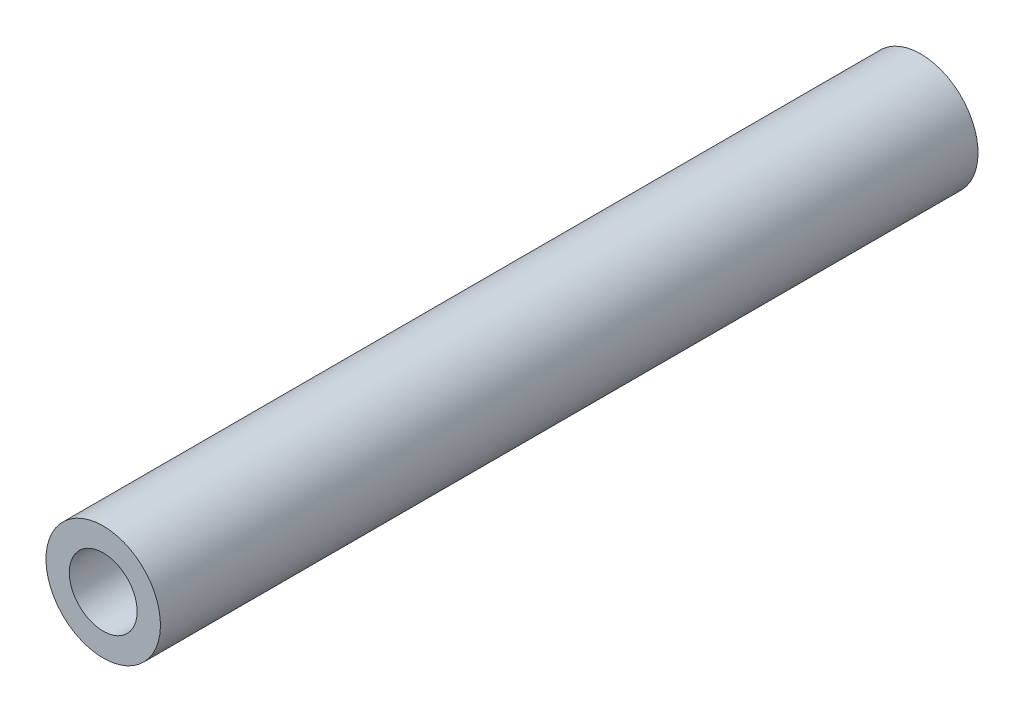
from build123d import *

# Parameters (mm, degrees)
SKETCH1_W = 100
SKETCH1_H = 2.85


with BuildPart() as part:
    # Sketch1 → Revolve1 (revolve)
    with BuildSketch(Plane(origin=(0, 0, 0), x_dir=(0, 0, -1), z_dir=(1, 0, 0))):
        with Locations((-50, 5.575)):
            Rectangle(SKETCH1_W, SKETCH1_H)
    revolve(axis=Axis((0, 0, 0), (0, 0, 1)))


solid = part.part
